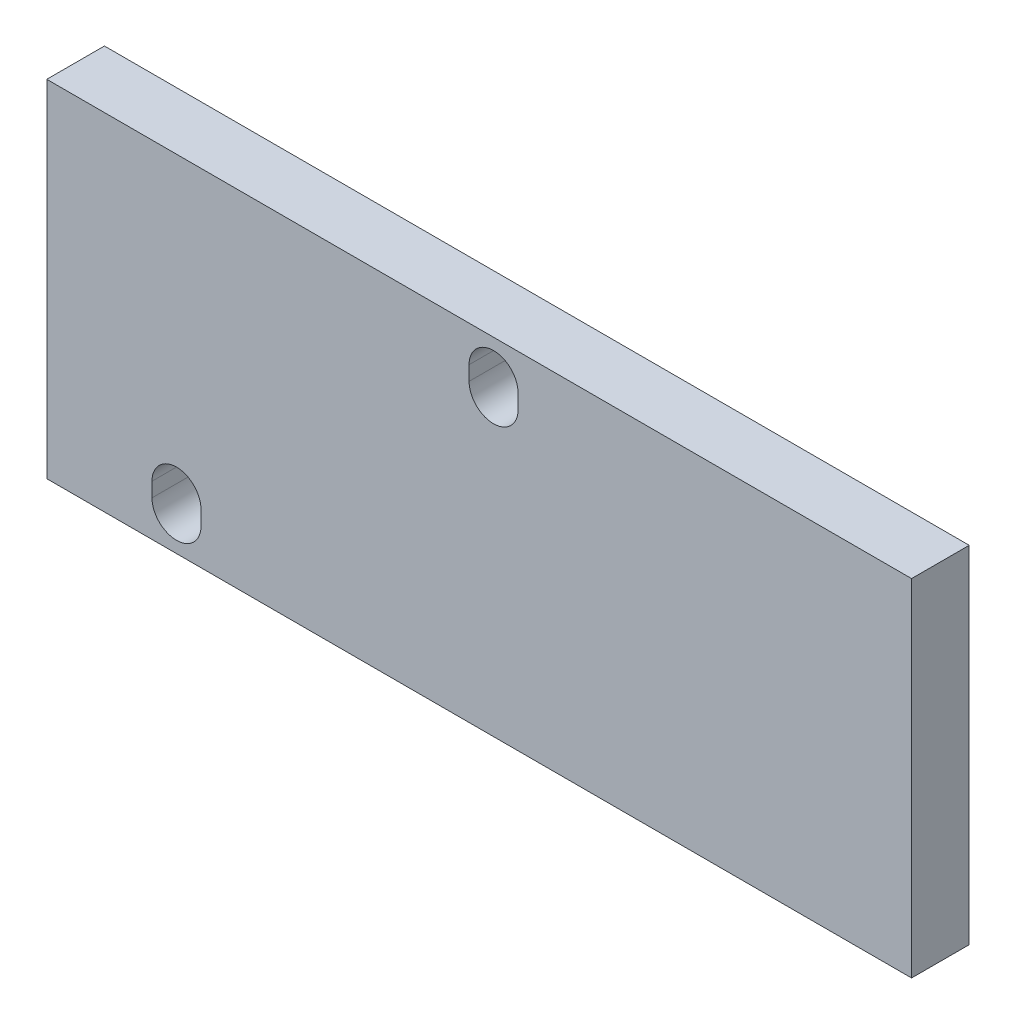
ISO-10303-21;
HEADER;
FILE_DESCRIPTION(('STEP AP214'),'2;1');
FILE_NAME('part.step','',(''),(''),'','','');
FILE_SCHEMA(('AUTOMOTIVE_DESIGN { 1 0 10303 214 1 1 1 1 }'));
ENDSEC;
DATA;
#1=APPLICATION_CONTEXT('core data for automotive mechanical design processes');
#2=APPLICATION_PROTOCOL_DEFINITION('international standard','automotive_design',2000,#1);
#3=PRODUCT_CONTEXT('',#1,'mechanical');
#4=PRODUCT('Part','Part','',(#3));
#5=PRODUCT_RELATED_PRODUCT_CATEGORY('part','',(#4));
#6=PRODUCT_DEFINITION_FORMATION('','',#4);
#7=PRODUCT_DEFINITION_CONTEXT('part definition',#1,'design');
#8=PRODUCT_DEFINITION('design','',#6,#7);
#9=PRODUCT_DEFINITION_SHAPE('','',#8);
#10=(LENGTH_UNIT() NAMED_UNIT(*) SI_UNIT(.MILLI.,.METRE.));
#11=(NAMED_UNIT(*) PLANE_ANGLE_UNIT() SI_UNIT($,.RADIAN.));
#12=(NAMED_UNIT(*) SI_UNIT($,.STERADIAN.) SOLID_ANGLE_UNIT());
#13=UNCERTAINTY_MEASURE_WITH_UNIT(LENGTH_MEASURE(1.E-05),#10,'distance_accuracy_value','');
#14=(GEOMETRIC_REPRESENTATION_CONTEXT(3) GLOBAL_UNCERTAINTY_ASSIGNED_CONTEXT((#13)) GLOBAL_UNIT_ASSIGNED_CONTEXT((#10,
#11,#12)) REPRESENTATION_CONTEXT('',''));
#15=CARTESIAN_POINT('',(0.,0.,0.));
#16=DIRECTION('',(0.,0.,1.));
#17=DIRECTION('',(1.,0.,0.));
#18=AXIS2_PLACEMENT_3D('',#15,#16,#17);
#19=CARTESIAN_POINT('',(149.999999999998,-1.88737914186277E-12,0.));
#20=DIRECTION('',(0.,0.,-0.999999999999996));
#21=DIRECTION('',(-0.999999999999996,0.,0.));
#22=AXIS2_PLACEMENT_3D('',#19,#20,#21);
#23=PLANE('',#22);
#24=DIRECTION('',(0.,1.,0.));
#25=VECTOR('',#24,1.);
#26=CARTESIAN_POINT('',(81.749999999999,51.2499999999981,0.));
#27=LINE('',#26,#25);
#28=CARTESIAN_POINT('',(81.749999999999,51.2499999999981,0.));
#29=VERTEX_POINT('',#28);
#30=CARTESIAN_POINT('',(81.749999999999,53.7499999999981,0.));
#31=VERTEX_POINT('',#30);
#32=EDGE_CURVE('E143',#29,#31,#27,.T.);
#33=ORIENTED_EDGE('',*,*,#32,.F.);
#34=CARTESIAN_POINT('',(77.4999999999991,51.2499999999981,0.));
#35=DIRECTION('',(0.,0.,0.999999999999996));
#36=DIRECTION('',(-0.999999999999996,0.,0.));
#37=AXIS2_PLACEMENT_3D('',#34,#35,#36);
#38=CIRCLE('',#37,4.25);
#39=CARTESIAN_POINT('',(73.249999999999,51.2499999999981,0.));
#40=VERTEX_POINT('',#39);
#41=EDGE_CURVE('E57',#40,#29,#38,.T.);
#42=ORIENTED_EDGE('',*,*,#41,.F.);
#43=DIRECTION('',(0.,-1.,0.));
#44=VECTOR('',#43,1.);
#45=CARTESIAN_POINT('',(73.249999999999,51.2499999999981,0.));
#46=LINE('',#45,#44);
#47=CARTESIAN_POINT('',(73.249999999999,53.7499999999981,0.));
#48=VERTEX_POINT('',#47);
#49=EDGE_CURVE('E150',#48,#40,#46,.T.);
#50=ORIENTED_EDGE('',*,*,#49,.F.);
#51=CARTESIAN_POINT('',(77.4999999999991,53.7499999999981,0.));
#52=DIRECTION('',(0.,0.,0.999999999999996));
#53=DIRECTION('',(0.999999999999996,0.,0.));
#54=AXIS2_PLACEMENT_3D('',#51,#52,#53);
#55=CIRCLE('',#54,4.25);
#56=EDGE_CURVE('E133',#31,#48,#55,.T.);
#57=ORIENTED_EDGE('',*,*,#56,.F.);
#58=EDGE_LOOP('',(#33,#42,#50,#57));
#59=FACE_BOUND('',#58,.T.);
#60=DIRECTION('',(0.,1.,0.));
#61=VECTOR('',#60,1.);
#62=CARTESIAN_POINT('',(26.7499999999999,6.24999999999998,0.));
#63=LINE('',#62,#61);
#64=CARTESIAN_POINT('',(26.7499999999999,6.24999999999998,0.));
#65=VERTEX_POINT('',#64);
#66=CARTESIAN_POINT('',(26.7499999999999,8.75000000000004,0.));
#67=VERTEX_POINT('',#66);
#68=EDGE_CURVE('E180',#65,#67,#63,.T.);
#69=ORIENTED_EDGE('',*,*,#68,.F.);
#70=CARTESIAN_POINT('',(22.5,6.24999999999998,0.));
#71=DIRECTION('',(0.,0.,0.999999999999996));
#72=DIRECTION('',(-0.999999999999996,0.,0.));
#73=AXIS2_PLACEMENT_3D('',#70,#71,#72);
#74=CIRCLE('',#73,4.25);
#75=CARTESIAN_POINT('',(18.25,6.24999999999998,0.));
#76=VERTEX_POINT('',#75);
#77=EDGE_CURVE('E175',#76,#65,#74,.T.);
#78=ORIENTED_EDGE('',*,*,#77,.F.);
#79=DIRECTION('',(0.,-1.,0.));
#80=VECTOR('',#79,1.);
#81=CARTESIAN_POINT('',(18.25,6.24999999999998,0.));
#82=LINE('',#81,#80);
#83=CARTESIAN_POINT('',(18.25,8.75000000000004,0.));
#84=VERTEX_POINT('',#83);
#85=EDGE_CURVE('E188',#84,#76,#82,.T.);
#86=ORIENTED_EDGE('',*,*,#85,.F.);
#87=CARTESIAN_POINT('',(22.5,8.75000000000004,0.));
#88=DIRECTION('',(0.,0.,0.999999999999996));
#89=DIRECTION('',(0.999999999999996,0.,0.));
#90=AXIS2_PLACEMENT_3D('',#87,#88,#89);
#91=CIRCLE('',#90,4.25);
#92=EDGE_CURVE('E184',#67,#84,#91,.T.);
#93=ORIENTED_EDGE('',*,*,#92,.F.);
#94=EDGE_LOOP('',(#69,#78,#86,#93));
#95=FACE_BOUND('',#94,.T.);
#96=DIRECTION('',(0.,-1.,0.));
#97=VECTOR('',#96,1.);
#98=CARTESIAN_POINT('',(0.,0.,0.));
#99=LINE('',#98,#97);
#100=CARTESIAN_POINT('',(0.,60.0000000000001,0.));
#101=VERTEX_POINT('',#100);
#102=CARTESIAN_POINT('',(0.,0.,0.));
#103=VERTEX_POINT('',#102);
#104=EDGE_CURVE('E212',#101,#103,#99,.T.);
#105=ORIENTED_EDGE('',*,*,#104,.T.);
#106=DIRECTION('',(-0.999999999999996,0.,0.));
#107=VECTOR('',#106,1.);
#108=CARTESIAN_POINT('',(149.999999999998,-1.88737914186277E-12,0.));
#109=LINE('',#108,#107);
#110=CARTESIAN_POINT('',(149.999999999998,-1.88737914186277E-12,0.));
#111=VERTEX_POINT('',#110);
#112=EDGE_CURVE('E11',#111,#103,#109,.T.);
#113=ORIENTED_EDGE('',*,*,#112,.F.);
#114=DIRECTION('',(0.,-1.,0.));
#115=VECTOR('',#114,1.);
#116=CARTESIAN_POINT('',(149.999999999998,-1.88737914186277E-12,0.));
#117=LINE('',#116,#115);
#118=CARTESIAN_POINT('',(149.999999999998,59.9999999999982,0.));
#119=VERTEX_POINT('',#118);
#120=EDGE_CURVE('E234',#119,#111,#117,.T.);
#121=ORIENTED_EDGE('',*,*,#120,.F.);
#122=DIRECTION('',(-0.999999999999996,0.,0.));
#123=VECTOR('',#122,1.);
#124=CARTESIAN_POINT('',(149.999999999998,59.9999999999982,0.));
#125=LINE('',#124,#123);
#126=EDGE_CURVE('E247',#119,#101,#125,.T.);
#127=ORIENTED_EDGE('',*,*,#126,.T.);
#128=EDGE_LOOP('',(#105,#113,#121,#127));
#129=FACE_BOUND('',#128,.T.);
#130=ADVANCED_FACE('F42',(#59,#95,#129),#23,.F.);
#131=CARTESIAN_POINT('',(149.999999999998,-1.88737914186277E-12,0.));
#132=DIRECTION('',(0.,1.,0.));
#133=DIRECTION('',(0.,0.,0.999999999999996));
#134=AXIS2_PLACEMENT_3D('',#131,#132,#133);
#135=PLANE('',#134);
#136=DIRECTION('',(0.,0.,-0.999999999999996));
#137=VECTOR('',#136,1.);
#138=CARTESIAN_POINT('',(0.,0.,0.));
#139=LINE('',#138,#137);
#140=CARTESIAN_POINT('',(0.,0.,-10.));
#141=VERTEX_POINT('',#140);
#142=EDGE_CURVE('E225',#103,#141,#139,.T.);
#143=ORIENTED_EDGE('',*,*,#142,.T.);
#144=DIRECTION('',(-0.999999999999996,0.,0.));
#145=VECTOR('',#144,1.);
#146=CARTESIAN_POINT('',(149.999999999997,-1.88737914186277E-12,-10.));
#147=LINE('',#146,#145);
#148=CARTESIAN_POINT('',(149.999999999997,-1.88737914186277E-12,-10.));
#149=VERTEX_POINT('',#148);
#150=EDGE_CURVE('E50',#149,#141,#147,.T.);
#151=ORIENTED_EDGE('',*,*,#150,.F.);
#152=DIRECTION('',(0.,0.,-0.999999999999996));
#153=VECTOR('',#152,1.);
#154=CARTESIAN_POINT('',(149.999999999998,-1.88737914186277E-12,0.));
#155=LINE('',#154,#153);
#156=EDGE_CURVE('E238',#111,#149,#155,.T.);
#157=ORIENTED_EDGE('',*,*,#156,.F.);
#158=ORIENTED_EDGE('',*,*,#112,.T.);
#159=EDGE_LOOP('',(#143,#151,#157,#158));
#160=FACE_BOUND('',#159,.T.);
#161=ADVANCED_FACE('F276',(#160),#135,.F.);
#162=CARTESIAN_POINT('',(149.999999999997,-1.88737914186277E-12,-10.));
#163=DIRECTION('',(0.,0.,0.999999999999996));
#164=DIRECTION('',(0.999999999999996,0.,0.));
#165=AXIS2_PLACEMENT_3D('',#162,#163,#164);
#166=PLANE('',#165);
#167=DIRECTION('',(0.,-1.,0.));
#168=VECTOR('',#167,1.);
#169=CARTESIAN_POINT('',(73.2499999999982,51.2499999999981,-10.));
#170=LINE('',#169,#168);
#171=CARTESIAN_POINT('',(73.2499999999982,53.7499999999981,-10.));
#172=VERTEX_POINT('',#171);
#173=CARTESIAN_POINT('',(73.2499999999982,51.2499999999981,-10.));
#174=VERTEX_POINT('',#173);
#175=EDGE_CURVE('E168',#172,#174,#170,.T.);
#176=ORIENTED_EDGE('',*,*,#175,.T.);
#177=CARTESIAN_POINT('',(77.4999999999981,51.2499999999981,-10.));
#178=DIRECTION('',(0.,0.,0.999999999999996));
#179=DIRECTION('',(-0.999999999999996,0.,0.));
#180=AXIS2_PLACEMENT_3D('',#177,#178,#179);
#181=CIRCLE('',#180,4.25);
#182=CARTESIAN_POINT('',(81.7499999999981,51.2499999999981,-10.));
#183=VERTEX_POINT('',#182);
#184=EDGE_CURVE('E156',#174,#183,#181,.T.);
#185=ORIENTED_EDGE('',*,*,#184,.T.);
#186=DIRECTION('',(0.,1.,0.));
#187=VECTOR('',#186,1.);
#188=CARTESIAN_POINT('',(81.7499999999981,51.2499999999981,-10.));
#189=LINE('',#188,#187);
#190=CARTESIAN_POINT('',(81.7499999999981,53.7499999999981,-10.));
#191=VERTEX_POINT('',#190);
#192=EDGE_CURVE('E163',#183,#191,#189,.T.);
#193=ORIENTED_EDGE('',*,*,#192,.T.);
#194=CARTESIAN_POINT('',(77.4999999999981,53.7499999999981,-10.));
#195=DIRECTION('',(0.,0.,0.999999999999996));
#196=DIRECTION('',(0.999999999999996,0.,0.));
#197=AXIS2_PLACEMENT_3D('',#194,#195,#196);
#198=CIRCLE('',#197,4.25);
#199=EDGE_CURVE('E65',#191,#172,#198,.T.);
#200=ORIENTED_EDGE('',*,*,#199,.T.);
#201=EDGE_LOOP('',(#176,#185,#193,#200));
#202=FACE_BOUND('',#201,.T.);
#203=DIRECTION('',(0.,-1.,0.));
#204=VECTOR('',#203,1.);
#205=CARTESIAN_POINT('',(18.25,6.24999999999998,-10.));
#206=LINE('',#205,#204);
#207=CARTESIAN_POINT('',(18.25,8.75000000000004,-10.));
#208=VERTEX_POINT('',#207);
#209=CARTESIAN_POINT('',(18.25,6.24999999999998,-10.));
#210=VERTEX_POINT('',#209);
#211=EDGE_CURVE('E204',#208,#210,#206,.T.);
#212=ORIENTED_EDGE('',*,*,#211,.T.);
#213=CARTESIAN_POINT('',(22.5000000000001,6.24999999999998,-10.));
#214=DIRECTION('',(0.,0.,0.999999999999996));
#215=DIRECTION('',(-0.999999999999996,0.,0.));
#216=AXIS2_PLACEMENT_3D('',#213,#214,#215);
#217=CIRCLE('',#216,4.25);
#218=CARTESIAN_POINT('',(26.75,6.24999999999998,-10.));
#219=VERTEX_POINT('',#218);
#220=EDGE_CURVE('E192',#210,#219,#217,.T.);
#221=ORIENTED_EDGE('',*,*,#220,.T.);
#222=DIRECTION('',(0.,1.,0.));
#223=VECTOR('',#222,1.);
#224=CARTESIAN_POINT('',(26.75,6.24999999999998,-10.));
#225=LINE('',#224,#223);
#226=CARTESIAN_POINT('',(26.75,8.75000000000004,-10.));
#227=VERTEX_POINT('',#226);
#228=EDGE_CURVE('E196',#219,#227,#225,.T.);
#229=ORIENTED_EDGE('',*,*,#228,.T.);
#230=CARTESIAN_POINT('',(22.5000000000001,8.75000000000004,-10.));
#231=DIRECTION('',(0.,0.,0.999999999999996));
#232=DIRECTION('',(0.999999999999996,0.,0.));
#233=AXIS2_PLACEMENT_3D('',#230,#231,#232);
#234=CIRCLE('',#233,4.25);
#235=EDGE_CURVE('E200',#227,#208,#234,.T.);
#236=ORIENTED_EDGE('',*,*,#235,.T.);
#237=EDGE_LOOP('',(#212,#221,#229,#236));
#238=FACE_BOUND('',#237,.T.);
#239=DIRECTION('',(0.,1.,0.));
#240=VECTOR('',#239,1.);
#241=CARTESIAN_POINT('',(0.,0.,-10.));
#242=LINE('',#241,#240);
#243=CARTESIAN_POINT('',(0.,60.0000000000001,-10.));
#244=VERTEX_POINT('',#243);
#245=EDGE_CURVE('E228',#141,#244,#242,.T.);
#246=ORIENTED_EDGE('',*,*,#245,.T.);
#247=DIRECTION('',(-0.999999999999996,0.,0.));
#248=VECTOR('',#247,1.);
#249=CARTESIAN_POINT('',(149.999999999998,59.9999999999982,-10.));
#250=LINE('',#249,#248);
#251=CARTESIAN_POINT('',(149.999999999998,59.9999999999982,-10.));
#252=VERTEX_POINT('',#251);
#253=EDGE_CURVE('E251',#252,#244,#250,.T.);
#254=ORIENTED_EDGE('',*,*,#253,.F.);
#255=DIRECTION('',(0.,1.,0.));
#256=VECTOR('',#255,1.);
#257=CARTESIAN_POINT('',(149.999999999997,-1.88737914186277E-12,-10.));
#258=LINE('',#257,#256);
#259=EDGE_CURVE('E241',#149,#252,#258,.T.);
#260=ORIENTED_EDGE('',*,*,#259,.F.);
#261=ORIENTED_EDGE('',*,*,#150,.T.);
#262=EDGE_LOOP('',(#246,#254,#260,#261));
#263=FACE_BOUND('',#262,.T.);
#264=ADVANCED_FACE('F260',(#202,#238,#263),#166,.F.);
#265=CARTESIAN_POINT('',(149.999999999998,59.9999999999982,0.));
#266=DIRECTION('',(0.,-1.,0.));
#267=DIRECTION('',(0.,0.,-0.999999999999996));
#268=AXIS2_PLACEMENT_3D('',#265,#266,#267);
#269=PLANE('',#268);
#270=DIRECTION('',(0.,0.,0.999999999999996));
#271=VECTOR('',#270,1.);
#272=CARTESIAN_POINT('',(0.,60.0000000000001,0.));
#273=LINE('',#272,#271);
#274=EDGE_CURVE('E231',#244,#101,#273,.T.);
#275=ORIENTED_EDGE('',*,*,#274,.T.);
#276=ORIENTED_EDGE('',*,*,#126,.F.);
#277=DIRECTION('',(0.,0.,0.999999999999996));
#278=VECTOR('',#277,1.);
#279=CARTESIAN_POINT('',(149.999999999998,59.9999999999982,0.));
#280=LINE('',#279,#278);
#281=EDGE_CURVE('E244',#252,#119,#280,.T.);
#282=ORIENTED_EDGE('',*,*,#281,.F.);
#283=ORIENTED_EDGE('',*,*,#253,.T.);
#284=EDGE_LOOP('',(#275,#276,#282,#283));
#285=FACE_BOUND('',#284,.T.);
#286=ADVANCED_FACE('F269',(#285),#269,.F.);
#287=CARTESIAN_POINT('',(149.999999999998,59.9999999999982,0.));
#288=DIRECTION('',(-0.999999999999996,0.,0.));
#289=DIRECTION('',(0.,0.,0.999999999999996));
#290=AXIS2_PLACEMENT_3D('',#287,#288,#289);
#291=PLANE('',#290);
#292=ORIENTED_EDGE('',*,*,#120,.T.);
#293=ORIENTED_EDGE('',*,*,#156,.T.);
#294=ORIENTED_EDGE('',*,*,#259,.T.);
#295=ORIENTED_EDGE('',*,*,#281,.T.);
#296=EDGE_LOOP('',(#292,#293,#294,#295));
#297=FACE_BOUND('',#296,.T.);
#298=ADVANCED_FACE('F275',(#297),#291,.F.);
#299=CARTESIAN_POINT('',(0.,60.0000000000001,0.));
#300=DIRECTION('',(-0.999999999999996,0.,0.));
#301=DIRECTION('',(0.,0.,0.999999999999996));
#302=AXIS2_PLACEMENT_3D('',#299,#300,#301);
#303=PLANE('',#302);
#304=ORIENTED_EDGE('',*,*,#104,.F.);
#305=ORIENTED_EDGE('',*,*,#274,.F.);
#306=ORIENTED_EDGE('',*,*,#245,.F.);
#307=ORIENTED_EDGE('',*,*,#142,.F.);
#308=EDGE_LOOP('',(#304,#305,#306,#307));
#309=FACE_BOUND('',#308,.T.);
#310=ADVANCED_FACE('F266',(#309),#303,.T.);
#311=CARTESIAN_POINT('',(22.5000000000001,6.24999999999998,-10.));
#312=DIRECTION('',(0.,0.,0.999999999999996));
#313=DIRECTION('',(0.999999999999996,0.,0.));
#314=AXIS2_PLACEMENT_3D('',#311,#312,#313);
#315=CYLINDRICAL_SURFACE('',#314,4.25);
#316=ORIENTED_EDGE('',*,*,#77,.T.);
#317=DIRECTION('',(0.,0.,0.999999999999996));
#318=VECTOR('',#317,1.);
#319=CARTESIAN_POINT('',(26.75,6.24999999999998,-10.));
#320=LINE('',#319,#318);
#321=EDGE_CURVE('E208',#219,#65,#320,.T.);
#322=ORIENTED_EDGE('',*,*,#321,.F.);
#323=ORIENTED_EDGE('',*,*,#220,.F.);
#324=DIRECTION('',(0.,0.,0.999999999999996));
#325=VECTOR('',#324,1.);
#326=CARTESIAN_POINT('',(18.25,6.24999999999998,-10.));
#327=LINE('',#326,#325);
#328=EDGE_CURVE('E209',#210,#76,#327,.T.);
#329=ORIENTED_EDGE('',*,*,#328,.T.);
#330=EDGE_LOOP('',(#316,#322,#323,#329));
#331=FACE_BOUND('',#330,.T.);
#332=ADVANCED_FACE('F291',(#331),#315,.F.);
#333=CARTESIAN_POINT('',(18.25,6.24999999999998,-10.));
#334=DIRECTION('',(-0.999999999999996,0.,0.));
#335=DIRECTION('',(0.,0.,0.999999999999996));
#336=AXIS2_PLACEMENT_3D('',#333,#334,#335);
#337=PLANE('',#336);
#338=ORIENTED_EDGE('',*,*,#85,.T.);
#339=ORIENTED_EDGE('',*,*,#328,.F.);
#340=ORIENTED_EDGE('',*,*,#211,.F.);
#341=DIRECTION('',(0.,0.,0.999999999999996));
#342=VECTOR('',#341,1.);
#343=CARTESIAN_POINT('',(18.25,8.75000000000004,-10.));
#344=LINE('',#343,#342);
#345=EDGE_CURVE('E213',#208,#84,#344,.T.);
#346=ORIENTED_EDGE('',*,*,#345,.T.);
#347=EDGE_LOOP('',(#338,#339,#340,#346));
#348=FACE_BOUND('',#347,.T.);
#349=ADVANCED_FACE('F294',(#348),#337,.F.);
#350=CARTESIAN_POINT('',(22.5000000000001,8.75000000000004,-10.));
#351=DIRECTION('',(0.,0.,0.999999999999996));
#352=DIRECTION('',(0.999999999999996,0.,0.));
#353=AXIS2_PLACEMENT_3D('',#350,#351,#352);
#354=CYLINDRICAL_SURFACE('',#353,4.25);
#355=ORIENTED_EDGE('',*,*,#92,.T.);
#356=ORIENTED_EDGE('',*,*,#345,.F.);
#357=ORIENTED_EDGE('',*,*,#235,.F.);
#358=DIRECTION('',(0.,0.,0.999999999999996));
#359=VECTOR('',#358,1.);
#360=CARTESIAN_POINT('',(26.75,8.75000000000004,-10.));
#361=LINE('',#360,#359);
#362=EDGE_CURVE('E216',#227,#67,#361,.T.);
#363=ORIENTED_EDGE('',*,*,#362,.T.);
#364=EDGE_LOOP('',(#355,#356,#357,#363));
#365=FACE_BOUND('',#364,.T.);
#366=ADVANCED_FACE('F300',(#365),#354,.F.);
#367=CARTESIAN_POINT('',(26.75,6.24999999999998,-10.));
#368=DIRECTION('',(0.999999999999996,0.,0.));
#369=DIRECTION('',(0.,0.,-0.999999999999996));
#370=AXIS2_PLACEMENT_3D('',#367,#368,#369);
#371=PLANE('',#370);
#372=ORIENTED_EDGE('',*,*,#68,.T.);
#373=ORIENTED_EDGE('',*,*,#362,.F.);
#374=ORIENTED_EDGE('',*,*,#228,.F.);
#375=ORIENTED_EDGE('',*,*,#321,.T.);
#376=EDGE_LOOP('',(#372,#373,#374,#375));
#377=FACE_BOUND('',#376,.T.);
#378=ADVANCED_FACE('F296',(#377),#371,.F.);
#379=CARTESIAN_POINT('',(77.4999999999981,51.2499999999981,-10.));
#380=DIRECTION('',(0.,0.,0.999999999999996));
#381=DIRECTION('',(0.999999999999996,0.,0.));
#382=AXIS2_PLACEMENT_3D('',#379,#380,#381);
#383=CYLINDRICAL_SURFACE('',#382,4.25);
#384=ORIENTED_EDGE('',*,*,#41,.T.);
#385=DIRECTION('',(0.,0.,0.999999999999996));
#386=VECTOR('',#385,1.);
#387=CARTESIAN_POINT('',(81.7499999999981,51.2499999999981,-10.));
#388=LINE('',#387,#386);
#389=EDGE_CURVE('E140',#183,#29,#388,.T.);
#390=ORIENTED_EDGE('',*,*,#389,.F.);
#391=ORIENTED_EDGE('',*,*,#184,.F.);
#392=DIRECTION('',(0.,0.,0.999999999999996));
#393=VECTOR('',#392,1.);
#394=CARTESIAN_POINT('',(73.2499999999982,51.2499999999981,-10.));
#395=LINE('',#394,#393);
#396=EDGE_CURVE('E172',#174,#40,#395,.T.);
#397=ORIENTED_EDGE('',*,*,#396,.T.);
#398=EDGE_LOOP('',(#384,#390,#391,#397));
#399=FACE_BOUND('',#398,.T.);
#400=ADVANCED_FACE('F299',(#399),#383,.F.);
#401=CARTESIAN_POINT('',(73.2499999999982,51.2499999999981,-10.));
#402=DIRECTION('',(-0.999999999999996,0.,0.));
#403=DIRECTION('',(0.,0.,0.999999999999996));
#404=AXIS2_PLACEMENT_3D('',#401,#402,#403);
#405=PLANE('',#404);
#406=ORIENTED_EDGE('',*,*,#49,.T.);
#407=ORIENTED_EDGE('',*,*,#396,.F.);
#408=ORIENTED_EDGE('',*,*,#175,.F.);
#409=DIRECTION('',(0.,0.,0.999999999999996));
#410=VECTOR('',#409,1.);
#411=CARTESIAN_POINT('',(73.2499999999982,53.7499999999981,-10.));
#412=LINE('',#411,#410);
#413=EDGE_CURVE('E139',#172,#48,#412,.T.);
#414=ORIENTED_EDGE('',*,*,#413,.T.);
#415=EDGE_LOOP('',(#406,#407,#408,#414));
#416=FACE_BOUND('',#415,.T.);
#417=ADVANCED_FACE('F310',(#416),#405,.F.);
#418=CARTESIAN_POINT('',(77.4999999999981,53.7499999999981,-10.));
#419=DIRECTION('',(0.,0.,0.999999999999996));
#420=DIRECTION('',(0.999999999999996,0.,0.));
#421=AXIS2_PLACEMENT_3D('',#418,#419,#420);
#422=CYLINDRICAL_SURFACE('',#421,4.25);
#423=ORIENTED_EDGE('',*,*,#56,.T.);
#424=ORIENTED_EDGE('',*,*,#413,.F.);
#425=ORIENTED_EDGE('',*,*,#199,.F.);
#426=DIRECTION('',(0.,0.,0.999999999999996));
#427=VECTOR('',#426,1.);
#428=CARTESIAN_POINT('',(81.7499999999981,53.7499999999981,-10.));
#429=LINE('',#428,#427);
#430=EDGE_CURVE('E129',#191,#31,#429,.T.);
#431=ORIENTED_EDGE('',*,*,#430,.T.);
#432=EDGE_LOOP('',(#423,#424,#425,#431));
#433=FACE_BOUND('',#432,.T.);
#434=ADVANCED_FACE('F131',(#433),#422,.F.);
#435=CARTESIAN_POINT('',(81.7499999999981,51.2499999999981,-10.));
#436=DIRECTION('',(0.999999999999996,0.,0.));
#437=DIRECTION('',(0.,0.,-0.999999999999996));
#438=AXIS2_PLACEMENT_3D('',#435,#436,#437);
#439=PLANE('',#438);
#440=ORIENTED_EDGE('',*,*,#32,.T.);
#441=ORIENTED_EDGE('',*,*,#430,.F.);
#442=ORIENTED_EDGE('',*,*,#192,.F.);
#443=ORIENTED_EDGE('',*,*,#389,.T.);
#444=EDGE_LOOP('',(#440,#441,#442,#443));
#445=FACE_BOUND('',#444,.T.);
#446=ADVANCED_FACE('F144',(#445),#439,.F.);
#447=CLOSED_SHELL('',(#130,#161,#264,#286,#298,#310,#332,#349,#366,#378,#400,#417,#434,#446));
#448=MANIFOLD_SOLID_BREP('B2',#447);
#449=ADVANCED_BREP_SHAPE_REPRESENTATION('',(#18,#448),#14);
#450=SHAPE_DEFINITION_REPRESENTATION(#9,#449);
ENDSEC;
END-ISO-10303-21;
